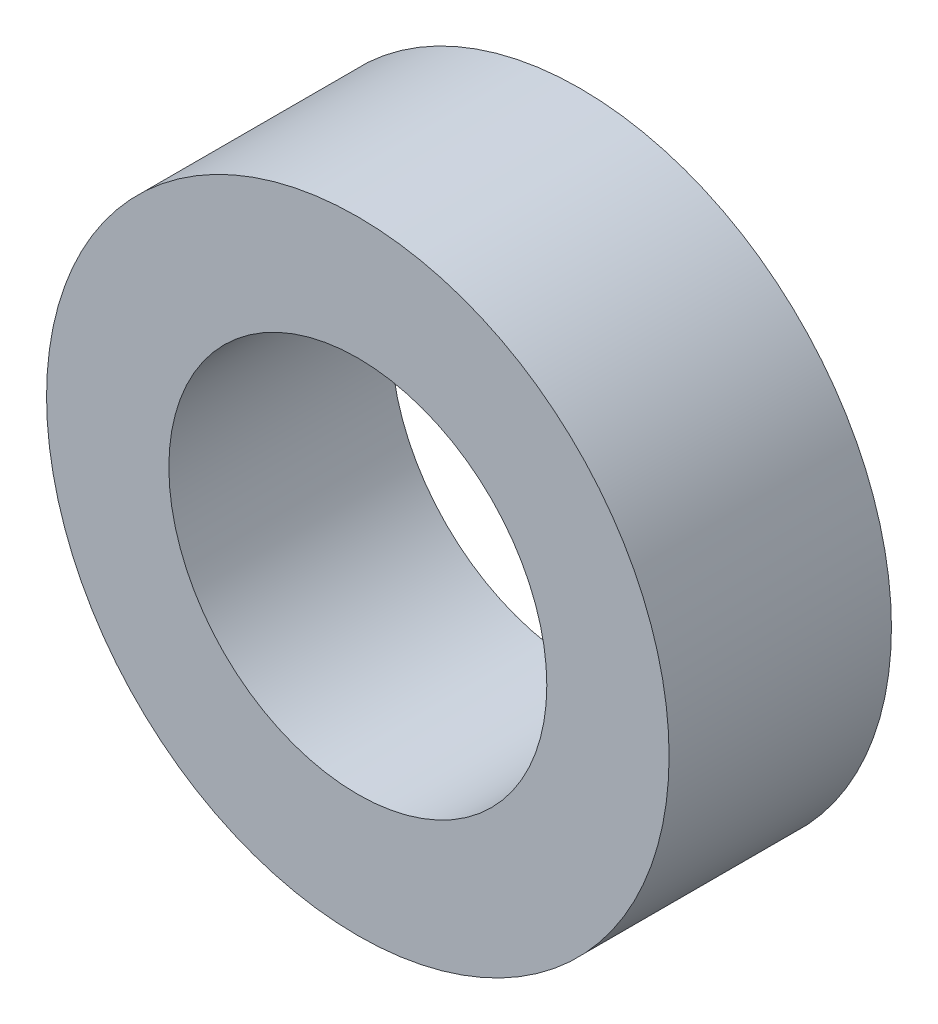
ISO-10303-21;
HEADER;
FILE_DESCRIPTION(('STEP AP214'),'2;1');
FILE_NAME('part.step','',(''),(''),'','','');
FILE_SCHEMA(('AUTOMOTIVE_DESIGN { 1 0 10303 214 1 1 1 1 }'));
ENDSEC;
DATA;
#1=APPLICATION_CONTEXT('core data for automotive mechanical design processes');
#2=APPLICATION_PROTOCOL_DEFINITION('international standard','automotive_design',2000,#1);
#3=PRODUCT_CONTEXT('',#1,'mechanical');
#4=PRODUCT('Part','Part','',(#3));
#5=PRODUCT_RELATED_PRODUCT_CATEGORY('part','',(#4));
#6=PRODUCT_DEFINITION_FORMATION('','',#4);
#7=PRODUCT_DEFINITION_CONTEXT('part definition',#1,'design');
#8=PRODUCT_DEFINITION('design','',#6,#7);
#9=PRODUCT_DEFINITION_SHAPE('','',#8);
#10=(LENGTH_UNIT() NAMED_UNIT(*) SI_UNIT(.MILLI.,.METRE.));
#11=(NAMED_UNIT(*) PLANE_ANGLE_UNIT() SI_UNIT($,.RADIAN.));
#12=(NAMED_UNIT(*) SI_UNIT($,.STERADIAN.) SOLID_ANGLE_UNIT());
#13=UNCERTAINTY_MEASURE_WITH_UNIT(LENGTH_MEASURE(1.E-05),#10,'distance_accuracy_value','');
#14=(GEOMETRIC_REPRESENTATION_CONTEXT(3) GLOBAL_UNCERTAINTY_ASSIGNED_CONTEXT((#13)) GLOBAL_UNIT_ASSIGNED_CONTEXT((#10,
#11,#12)) REPRESENTATION_CONTEXT('',''));
#15=CARTESIAN_POINT('',(0.,0.,0.));
#16=DIRECTION('',(0.,0.,1.));
#17=DIRECTION('',(1.,0.,0.));
#18=AXIS2_PLACEMENT_3D('',#15,#16,#17);
#19=CARTESIAN_POINT('',(0.,0.,10.));
#20=DIRECTION('',(0.,0.,1.));
#21=DIRECTION('',(1.,0.,0.));
#22=AXIS2_PLACEMENT_3D('',#19,#20,#21);
#23=PLANE('',#22);
#24=CARTESIAN_POINT('',(0.,0.,10.));
#25=DIRECTION('',(0.,0.,1.));
#26=DIRECTION('',(1.,0.,0.));
#27=AXIS2_PLACEMENT_3D('',#24,#25,#26);
#28=CIRCLE('',#27,14.);
#29=CARTESIAN_POINT('',(14.,0.,10.));
#30=VERTEX_POINT('',#29);
#31=EDGE_CURVE('E8',#30,#30,#28,.T.);
#32=ORIENTED_EDGE('',*,*,#31,.T.);
#33=EDGE_LOOP('',(#32));
#34=FACE_BOUND('',#33,.T.);
#35=CARTESIAN_POINT('',(0.,0.,10.));
#36=DIRECTION('',(0.,0.,1.));
#37=DIRECTION('',(1.,0.,0.));
#38=AXIS2_PLACEMENT_3D('',#35,#36,#37);
#39=CIRCLE('',#38,8.5);
#40=CARTESIAN_POINT('',(8.5,0.,10.));
#41=VERTEX_POINT('',#40);
#42=EDGE_CURVE('E23',#41,#41,#39,.T.);
#43=ORIENTED_EDGE('',*,*,#42,.F.);
#44=EDGE_LOOP('',(#43));
#45=FACE_BOUND('',#44,.T.);
#46=ADVANCED_FACE('F12',(#34,#45),#23,.T.);
#47=CARTESIAN_POINT('',(0.,0.,0.));
#48=DIRECTION('',(0.,0.,1.));
#49=DIRECTION('',(1.,0.,0.));
#50=AXIS2_PLACEMENT_3D('',#47,#48,#49);
#51=PLANE('',#50);
#52=CARTESIAN_POINT('',(0.,0.,0.));
#53=DIRECTION('',(0.,0.,1.));
#54=DIRECTION('',(1.,0.,0.));
#55=AXIS2_PLACEMENT_3D('',#52,#53,#54);
#56=CIRCLE('',#55,14.);
#57=CARTESIAN_POINT('',(14.,0.,0.));
#58=VERTEX_POINT('',#57);
#59=EDGE_CURVE('E16',#58,#58,#56,.T.);
#60=ORIENTED_EDGE('',*,*,#59,.F.);
#61=EDGE_LOOP('',(#60));
#62=FACE_BOUND('',#61,.T.);
#63=CARTESIAN_POINT('',(0.,0.,0.));
#64=DIRECTION('',(0.,0.,1.));
#65=DIRECTION('',(1.,0.,0.));
#66=AXIS2_PLACEMENT_3D('',#63,#64,#65);
#67=CIRCLE('',#66,8.5);
#68=CARTESIAN_POINT('',(8.5,0.,0.));
#69=VERTEX_POINT('',#68);
#70=EDGE_CURVE('E25',#69,#69,#67,.T.);
#71=ORIENTED_EDGE('',*,*,#70,.T.);
#72=EDGE_LOOP('',(#71));
#73=FACE_BOUND('',#72,.T.);
#74=ADVANCED_FACE('F35',(#62,#73),#51,.F.);
#75=CARTESIAN_POINT('',(0.,0.,10.));
#76=DIRECTION('',(0.,0.,-1.));
#77=DIRECTION('',(-1.,0.,0.));
#78=AXIS2_PLACEMENT_3D('',#75,#76,#77);
#79=CYLINDRICAL_SURFACE('',#78,14.);
#80=ORIENTED_EDGE('',*,*,#31,.F.);
#81=EDGE_LOOP('',(#80));
#82=FACE_BOUND('',#81,.T.);
#83=ORIENTED_EDGE('',*,*,#59,.T.);
#84=EDGE_LOOP('',(#83));
#85=FACE_BOUND('',#84,.T.);
#86=ADVANCED_FACE('F14',(#82,#85),#79,.T.);
#87=CARTESIAN_POINT('',(0.,0.,10.));
#88=DIRECTION('',(0.,0.,-1.));
#89=DIRECTION('',(-1.,0.,0.));
#90=AXIS2_PLACEMENT_3D('',#87,#88,#89);
#91=CYLINDRICAL_SURFACE('',#90,8.5);
#92=ORIENTED_EDGE('',*,*,#42,.T.);
#93=EDGE_LOOP('',(#92));
#94=FACE_BOUND('',#93,.T.);
#95=ORIENTED_EDGE('',*,*,#70,.F.);
#96=EDGE_LOOP('',(#95));
#97=FACE_BOUND('',#96,.T.);
#98=ADVANCED_FACE('F31',(#94,#97),#91,.F.);
#99=CLOSED_SHELL('',(#46,#74,#86,#98));
#100=MANIFOLD_SOLID_BREP('B1',#99);
#101=ADVANCED_BREP_SHAPE_REPRESENTATION('',(#18,#100),#14);
#102=SHAPE_DEFINITION_REPRESENTATION(#9,#101);
ENDSEC;
END-ISO-10303-21;
